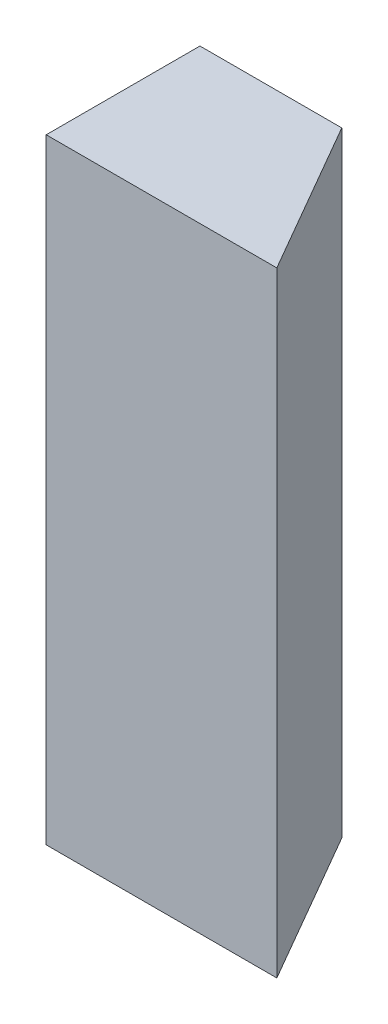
ISO-10303-21;
HEADER;
FILE_DESCRIPTION(('STEP AP214'),'2;1');
FILE_NAME('part.step','',(''),(''),'','','');
FILE_SCHEMA(('AUTOMOTIVE_DESIGN { 1 0 10303 214 1 1 1 1 }'));
ENDSEC;
DATA;
#1=APPLICATION_CONTEXT('core data for automotive mechanical design processes');
#2=APPLICATION_PROTOCOL_DEFINITION('international standard','automotive_design',2000,#1);
#3=PRODUCT_CONTEXT('',#1,'mechanical');
#4=PRODUCT('Part','Part','',(#3));
#5=PRODUCT_RELATED_PRODUCT_CATEGORY('part','',(#4));
#6=PRODUCT_DEFINITION_FORMATION('','',#4);
#7=PRODUCT_DEFINITION_CONTEXT('part definition',#1,'design');
#8=PRODUCT_DEFINITION('design','',#6,#7);
#9=PRODUCT_DEFINITION_SHAPE('','',#8);
#10=(LENGTH_UNIT() NAMED_UNIT(*) SI_UNIT(.MILLI.,.METRE.));
#11=(NAMED_UNIT(*) PLANE_ANGLE_UNIT() SI_UNIT($,.RADIAN.));
#12=(NAMED_UNIT(*) SI_UNIT($,.STERADIAN.) SOLID_ANGLE_UNIT());
#13=UNCERTAINTY_MEASURE_WITH_UNIT(LENGTH_MEASURE(1.E-05),#10,'distance_accuracy_value','');
#14=(GEOMETRIC_REPRESENTATION_CONTEXT(3) GLOBAL_UNCERTAINTY_ASSIGNED_CONTEXT((#13)) GLOBAL_UNIT_ASSIGNED_CONTEXT((#10,
#11,#12)) REPRESENTATION_CONTEXT('',''));
#15=CARTESIAN_POINT('',(0.,0.,0.));
#16=DIRECTION('',(0.,0.,1.));
#17=DIRECTION('',(1.,0.,0.));
#18=AXIS2_PLACEMENT_3D('',#15,#16,#17);
#19=CARTESIAN_POINT('',(22.5,30.,15.));
#20=DIRECTION('',(0.,0.,-1.));
#21=DIRECTION('',(-1.,0.,0.));
#22=AXIS2_PLACEMENT_3D('',#19,#20,#21);
#23=PLANE('',#22);
#24=DIRECTION('',(0.,-1.,0.));
#25=VECTOR('',#24,1.);
#26=CARTESIAN_POINT('',(0.,30.,15.));
#27=LINE('',#26,#25);
#28=CARTESIAN_POINT('',(0.,30.,15.));
#29=VERTEX_POINT('',#28);
#30=CARTESIAN_POINT('',(0.,-30.,15.));
#31=VERTEX_POINT('',#30);
#32=EDGE_CURVE('E71',#29,#31,#27,.T.);
#33=ORIENTED_EDGE('',*,*,#32,.T.);
#34=DIRECTION('',(1.,0.,0.));
#35=VECTOR('',#34,1.);
#36=CARTESIAN_POINT('',(22.5,-30.,15.));
#37=LINE('',#36,#35);
#38=CARTESIAN_POINT('',(22.5,-30.,15.));
#39=VERTEX_POINT('',#38);
#40=EDGE_CURVE('E66',#31,#39,#37,.T.);
#41=ORIENTED_EDGE('',*,*,#40,.T.);
#42=DIRECTION('',(0.,-1.,0.));
#43=VECTOR('',#42,1.);
#44=CARTESIAN_POINT('',(22.5,30.,15.));
#45=LINE('',#44,#43);
#46=CARTESIAN_POINT('',(22.5,30.,15.));
#47=VERTEX_POINT('',#46);
#48=EDGE_CURVE('E9',#47,#39,#45,.T.);
#49=ORIENTED_EDGE('',*,*,#48,.F.);
#50=DIRECTION('',(1.,0.,0.));
#51=VECTOR('',#50,1.);
#52=CARTESIAN_POINT('',(22.5,30.,15.));
#53=LINE('',#52,#51);
#54=EDGE_CURVE('E77',#29,#47,#53,.T.);
#55=ORIENTED_EDGE('',*,*,#54,.F.);
#56=EDGE_LOOP('',(#33,#41,#49,#55));
#57=FACE_BOUND('',#56,.T.);
#58=ADVANCED_FACE('F14',(#57),#23,.F.);
#59=CARTESIAN_POINT('',(13.8397459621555,30.,0.));
#60=DIRECTION('',(-0.866025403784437,0.,0.5));
#61=DIRECTION('',(0.5,0.,0.866025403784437));
#62=AXIS2_PLACEMENT_3D('',#59,#60,#61);
#63=PLANE('',#62);
#64=ORIENTED_EDGE('',*,*,#48,.T.);
#65=DIRECTION('',(-0.5,0.,-0.866025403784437));
#66=VECTOR('',#65,1.);
#67=CARTESIAN_POINT('',(13.8397459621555,-30.,0.));
#68=LINE('',#67,#66);
#69=CARTESIAN_POINT('',(13.8397459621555,-30.,0.));
#70=VERTEX_POINT('',#69);
#71=EDGE_CURVE('E56',#39,#70,#68,.T.);
#72=ORIENTED_EDGE('',*,*,#71,.T.);
#73=DIRECTION('',(0.,-1.,0.));
#74=VECTOR('',#73,1.);
#75=CARTESIAN_POINT('',(13.8397459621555,30.,0.));
#76=LINE('',#75,#74);
#77=CARTESIAN_POINT('',(13.8397459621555,30.,0.));
#78=VERTEX_POINT('',#77);
#79=EDGE_CURVE('E21',#78,#70,#76,.T.);
#80=ORIENTED_EDGE('',*,*,#79,.F.);
#81=DIRECTION('',(-0.5,0.,-0.866025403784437));
#82=VECTOR('',#81,1.);
#83=CARTESIAN_POINT('',(13.8397459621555,30.,0.));
#84=LINE('',#83,#82);
#85=EDGE_CURVE('E57',#47,#78,#84,.T.);
#86=ORIENTED_EDGE('',*,*,#85,.F.);
#87=EDGE_LOOP('',(#64,#72,#80,#86));
#88=FACE_BOUND('',#87,.T.);
#89=ADVANCED_FACE('F54',(#88),#63,.F.);
#90=CARTESIAN_POINT('',(0.,30.,0.));
#91=DIRECTION('',(0.,0.,1.));
#92=DIRECTION('',(1.,0.,0.));
#93=AXIS2_PLACEMENT_3D('',#90,#91,#92);
#94=PLANE('',#93);
#95=ORIENTED_EDGE('',*,*,#79,.T.);
#96=DIRECTION('',(-1.,0.,0.));
#97=VECTOR('',#96,1.);
#98=CARTESIAN_POINT('',(0.,-30.,0.));
#99=LINE('',#98,#97);
#100=CARTESIAN_POINT('',(0.,-30.,0.));
#101=VERTEX_POINT('',#100);
#102=EDGE_CURVE('E69',#70,#101,#99,.T.);
#103=ORIENTED_EDGE('',*,*,#102,.T.);
#104=DIRECTION('',(0.,-1.,0.));
#105=VECTOR('',#104,1.);
#106=CARTESIAN_POINT('',(0.,30.,0.));
#107=LINE('',#106,#105);
#108=CARTESIAN_POINT('',(0.,30.,0.));
#109=VERTEX_POINT('',#108);
#110=EDGE_CURVE('E83',#109,#101,#107,.T.);
#111=ORIENTED_EDGE('',*,*,#110,.F.);
#112=DIRECTION('',(-1.,0.,0.));
#113=VECTOR('',#112,1.);
#114=CARTESIAN_POINT('',(0.,30.,0.));
#115=LINE('',#114,#113);
#116=EDGE_CURVE('E33',#78,#109,#115,.T.);
#117=ORIENTED_EDGE('',*,*,#116,.F.);
#118=EDGE_LOOP('',(#95,#103,#111,#117));
#119=FACE_BOUND('',#118,.T.);
#120=ADVANCED_FACE('F85',(#119),#94,.F.);
#121=CARTESIAN_POINT('',(0.,30.,15.));
#122=DIRECTION('',(1.,0.,0.));
#123=DIRECTION('',(0.,0.,-1.));
#124=AXIS2_PLACEMENT_3D('',#121,#122,#123);
#125=PLANE('',#124);
#126=ORIENTED_EDGE('',*,*,#110,.T.);
#127=DIRECTION('',(0.,0.,1.));
#128=VECTOR('',#127,1.);
#129=CARTESIAN_POINT('',(0.,-30.,15.));
#130=LINE('',#129,#128);
#131=EDGE_CURVE('E75',#101,#31,#130,.T.);
#132=ORIENTED_EDGE('',*,*,#131,.T.);
#133=ORIENTED_EDGE('',*,*,#32,.F.);
#134=DIRECTION('',(0.,0.,1.));
#135=VECTOR('',#134,1.);
#136=CARTESIAN_POINT('',(0.,30.,15.));
#137=LINE('',#136,#135);
#138=EDGE_CURVE('E28',#109,#29,#137,.T.);
#139=ORIENTED_EDGE('',*,*,#138,.F.);
#140=EDGE_LOOP('',(#126,#132,#133,#139));
#141=FACE_BOUND('',#140,.T.);
#142=ADVANCED_FACE('F87',(#141),#125,.F.);
#143=CARTESIAN_POINT('',(0.,30.,15.));
#144=DIRECTION('',(0.,-1.,0.));
#145=DIRECTION('',(0.,0.,-1.));
#146=AXIS2_PLACEMENT_3D('',#143,#144,#145);
#147=PLANE('',#146);
#148=ORIENTED_EDGE('',*,*,#54,.T.);
#149=ORIENTED_EDGE('',*,*,#85,.T.);
#150=ORIENTED_EDGE('',*,*,#116,.T.);
#151=ORIENTED_EDGE('',*,*,#138,.T.);
#152=EDGE_LOOP('',(#148,#149,#150,#151));
#153=FACE_BOUND('',#152,.T.);
#154=ADVANCED_FACE('F88',(#153),#147,.F.);
#155=CARTESIAN_POINT('',(0.,-30.,15.));
#156=DIRECTION('',(0.,-1.,0.));
#157=DIRECTION('',(0.,0.,-1.));
#158=AXIS2_PLACEMENT_3D('',#155,#156,#157);
#159=PLANE('',#158);
#160=ORIENTED_EDGE('',*,*,#40,.F.);
#161=ORIENTED_EDGE('',*,*,#131,.F.);
#162=ORIENTED_EDGE('',*,*,#102,.F.);
#163=ORIENTED_EDGE('',*,*,#71,.F.);
#164=EDGE_LOOP('',(#160,#161,#162,#163));
#165=FACE_BOUND('',#164,.T.);
#166=ADVANCED_FACE('F64',(#165),#159,.T.);
#167=CLOSED_SHELL('',(#58,#89,#120,#142,#154,#166));
#168=MANIFOLD_SOLID_BREP('B1',#167);
#169=ADVANCED_BREP_SHAPE_REPRESENTATION('',(#18,#168),#14);
#170=SHAPE_DEFINITION_REPRESENTATION(#9,#169);
ENDSEC;
END-ISO-10303-21;
